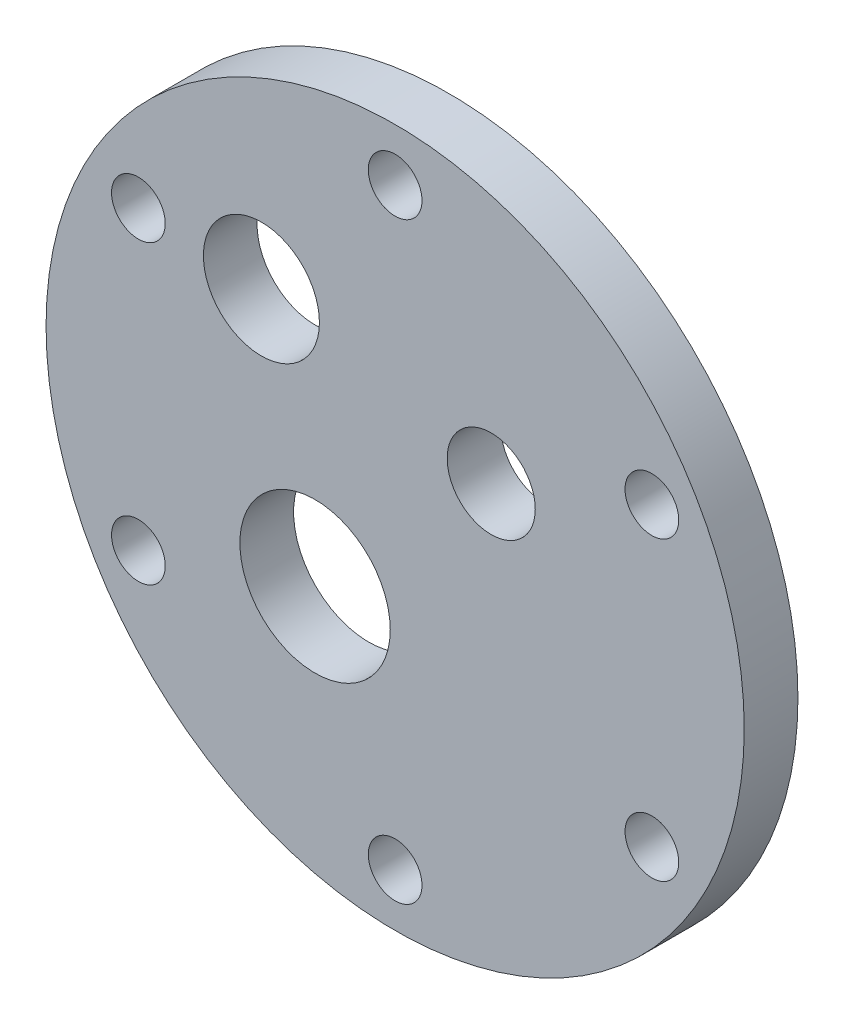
from build123d import *

# Parameters (mm, degrees)
SKETCH1_R           = 41.275
BOSS_EXTRUDE1_DEPTH = 6.35
SKETCH2_R           = 3.175
CUT_EXTRUDE2_DEPTH  = 59.716043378
CIRPATTERN2_COUNT   = 6
SKETCH4_R           = 6.858
CUT_EXTRUDE4_DEPTH  = 59.716043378
SKETCH5_R           = 8.89
CUT_EXTRUDE5_DEPTH  = 59.716043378
SKETCH6_R           = 5.207
CUT_EXTRUDE6_DEPTH  = 59.716043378


with BuildPart() as part:
    # Sketch1 → Boss-Extrude1 (new body)
    with BuildSketch(Plane.XY):
        Circle(SKETCH1_R)
    extrude(amount=BOSS_EXTRUDE1_DEPTH)

    # Sketch2 → Cut-Extrude2 (cut, through all)
    with BuildSketch(Plane.XY):
        with Locations((0, 35.052)):
            Circle(SKETCH2_R)
    cut_extrude2 = extrude(amount=CUT_EXTRUDE2_DEPTH, mode=Mode.SUBTRACT)

    # CirPattern2: Cut-Extrude2 ×6 about axis
    cirpattern2_axis = Axis((0, 0, 0), (0, 0, 1))
    for i in range(1, CIRPATTERN2_COUNT):
        add(cut_extrude2.rotate(cirpattern2_axis, i * 360 / CIRPATTERN2_COUNT), mode=Mode.SUBTRACT)

    # Sketch4 → Cut-Extrude4 (cut, through all)
    with BuildSketch(Plane.XY.offset(6.35)):
        with Locations((-15.811372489, 16.51)):
            Circle(SKETCH4_R)
    extrude(amount=-CUT_EXTRUDE4_DEPTH, mode=Mode.SUBTRACT)

    # Sketch5 → Cut-Extrude5 (cut, through all)
    with BuildSketch(Plane.XY.offset(6.35)):
        with Locations((-9.468444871, -10.759596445)):
            Circle(SKETCH5_R)
    extrude(amount=-CUT_EXTRUDE5_DEPTH, mode=Mode.SUBTRACT)

    # Sketch6 → Cut-Extrude6 (cut, through all)
    with BuildSketch(Plane.XY.offset(6.35)):
        with Locations((11.359225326, 10.16)):
            Circle(SKETCH6_R)
    extrude(amount=-CUT_EXTRUDE6_DEPTH, mode=Mode.SUBTRACT)


solid = part.part
